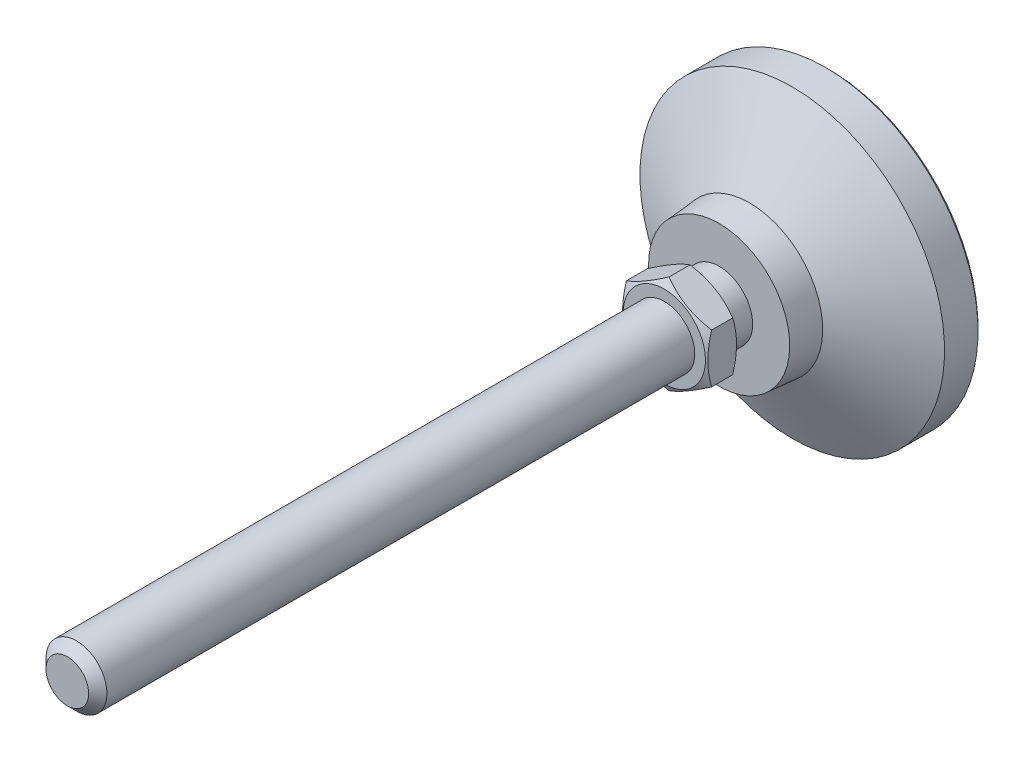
ISO-10303-21;
HEADER;
FILE_DESCRIPTION(('STEP AP214'),'2;1');
FILE_NAME('part.step','',(''),(''),'','','');
FILE_SCHEMA(('AUTOMOTIVE_DESIGN { 1 0 10303 214 1 1 1 1 }'));
ENDSEC;
DATA;
#1=APPLICATION_CONTEXT('core data for automotive mechanical design processes');
#2=APPLICATION_PROTOCOL_DEFINITION('international standard','automotive_design',2000,#1);
#3=PRODUCT_CONTEXT('',#1,'mechanical');
#4=PRODUCT('Part','Part','',(#3));
#5=PRODUCT_RELATED_PRODUCT_CATEGORY('part','',(#4));
#6=PRODUCT_DEFINITION_FORMATION('','',#4);
#7=PRODUCT_DEFINITION_CONTEXT('part definition',#1,'design');
#8=PRODUCT_DEFINITION('design','',#6,#7);
#9=PRODUCT_DEFINITION_SHAPE('','',#8);
#10=(LENGTH_UNIT() NAMED_UNIT(*) SI_UNIT(.MILLI.,.METRE.));
#11=(NAMED_UNIT(*) PLANE_ANGLE_UNIT() SI_UNIT($,.RADIAN.));
#12=(NAMED_UNIT(*) SI_UNIT($,.STERADIAN.) SOLID_ANGLE_UNIT());
#13=UNCERTAINTY_MEASURE_WITH_UNIT(LENGTH_MEASURE(1.E-05),#10,'distance_accuracy_value','');
#14=(GEOMETRIC_REPRESENTATION_CONTEXT(3) GLOBAL_UNCERTAINTY_ASSIGNED_CONTEXT((#13)) GLOBAL_UNIT_ASSIGNED_CONTEXT((#10,
#11,#12)) REPRESENTATION_CONTEXT('',''));
#15=CARTESIAN_POINT('',(0.,0.,0.));
#16=DIRECTION('',(0.,0.,1.));
#17=DIRECTION('',(1.,0.,0.));
#18=AXIS2_PLACEMENT_3D('',#15,#16,#17);
#19=CARTESIAN_POINT('',(0.,0.,-1.));
#20=DIRECTION('',(0.,0.,-1.));
#21=DIRECTION('',(0.,1.,0.));
#22=AXIS2_PLACEMENT_3D('',#19,#20,#21);
#23=CYLINDRICAL_SURFACE('',#22,5.50000000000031);
#24=CARTESIAN_POINT('',(0.,0.,22.));
#25=DIRECTION('',(0.,0.,-1.));
#26=DIRECTION('',(0.,1.,0.));
#27=AXIS2_PLACEMENT_3D('',#24,#25,#26);
#28=CIRCLE('',#27,5.50000000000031);
#29=CARTESIAN_POINT('',(0.,5.50000000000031,22.));
#30=VERTEX_POINT('',#29);
#31=EDGE_CURVE('E100',#30,#30,#28,.T.);
#32=ORIENTED_EDGE('',*,*,#31,.T.);
#33=EDGE_LOOP('',(#32));
#34=FACE_BOUND('',#33,.T.);
#35=CARTESIAN_POINT('',(0.,0.,18.));
#36=DIRECTION('',(0.,0.,-1.));
#37=DIRECTION('',(0.,1.,0.));
#38=AXIS2_PLACEMENT_3D('',#35,#36,#37);
#39=CIRCLE('',#38,5.50000000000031);
#40=CARTESIAN_POINT('',(0.,5.50000000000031,18.));
#41=VERTEX_POINT('',#40);
#42=EDGE_CURVE('E93',#41,#41,#39,.T.);
#43=ORIENTED_EDGE('',*,*,#42,.F.);
#44=EDGE_LOOP('',(#43));
#45=FACE_BOUND('',#44,.T.);
#46=ADVANCED_FACE('F14',(#34,#45),#23,.T.);
#47=CARTESIAN_POINT('',(-5.50000000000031,0.,22.));
#48=DIRECTION('',(0.,0.,1.));
#49=DIRECTION('',(0.,-1.,0.));
#50=AXIS2_PLACEMENT_3D('',#47,#48,#49);
#51=PLANE('',#50);
#52=CARTESIAN_POINT('',(0.,0.,22.));
#53=DIRECTION('',(0.,0.,1.));
#54=DIRECTION('',(0.,-1.,0.));
#55=AXIS2_PLACEMENT_3D('',#52,#53,#54);
#56=CIRCLE('',#55,6.75);
#57=CARTESIAN_POINT('',(0.,-6.75,22.));
#58=VERTEX_POINT('',#57);
#59=EDGE_CURVE('E280',#58,#58,#56,.T.);
#60=ORIENTED_EDGE('',*,*,#59,.F.);
#61=EDGE_LOOP('',(#60));
#62=FACE_BOUND('',#61,.T.);
#63=ORIENTED_EDGE('',*,*,#31,.F.);
#64=EDGE_LOOP('',(#63));
#65=FACE_BOUND('',#64,.T.);
#66=ADVANCED_FACE('F141',(#62,#65),#51,.F.);
#67=CARTESIAN_POINT('',(0.,5.50000000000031,18.));
#68=DIRECTION('',(0.,0.,-1.));
#69=DIRECTION('',(0.,1.,0.));
#70=AXIS2_PLACEMENT_3D('',#67,#68,#69);
#71=PLANE('',#70);
#72=ORIENTED_EDGE('',*,*,#42,.T.);
#73=EDGE_LOOP('',(#72));
#74=FACE_BOUND('',#73,.T.);
#75=CARTESIAN_POINT('',(0.,0.,18.));
#76=DIRECTION('',(0.,0.,-1.));
#77=DIRECTION('',(0.,1.,0.));
#78=AXIS2_PLACEMENT_3D('',#75,#76,#77);
#79=CIRCLE('',#78,11.5833333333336);
#80=CARTESIAN_POINT('',(0.,11.5833333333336,18.));
#81=VERTEX_POINT('',#80);
#82=EDGE_CURVE('E88',#81,#81,#79,.T.);
#83=ORIENTED_EDGE('',*,*,#82,.F.);
#84=EDGE_LOOP('',(#83));
#85=FACE_BOUND('',#84,.T.);
#86=ADVANCED_FACE('F147',(#74,#85),#71,.F.);
#87=CARTESIAN_POINT('',(0.,0.,0.));
#88=DIRECTION('',(0.,0.,1.));
#89=DIRECTION('',(0.,-1.,0.));
#90=AXIS2_PLACEMENT_3D('',#87,#88,#89);
#91=PLANE('',#90);
#92=CARTESIAN_POINT('',(0.,0.,0.));
#93=DIRECTION('',(0.,0.,1.));
#94=DIRECTION('',(0.,-1.,0.));
#95=AXIS2_PLACEMENT_3D('',#92,#93,#94);
#96=CIRCLE('',#95,24.5);
#97=CARTESIAN_POINT('',(0.,-24.5,0.));
#98=VERTEX_POINT('',#97);
#99=EDGE_CURVE('E28',#98,#98,#96,.F.);
#100=ORIENTED_EDGE('',*,*,#99,.T.);
#101=EDGE_LOOP('',(#100));
#102=FACE_BOUND('',#101,.T.);
#103=ADVANCED_FACE('F114',(#102),#91,.F.);
#104=CARTESIAN_POINT('',(0.,0.,-1.));
#105=DIRECTION('',(0.,0.,-1.));
#106=DIRECTION('',(0.,1.,0.));
#107=AXIS2_PLACEMENT_3D('',#104,#105,#106);
#108=CYLINDRICAL_SURFACE('',#107,25.);
#109=CARTESIAN_POINT('',(0.,0.,0.5));
#110=DIRECTION('',(0.,0.,1.));
#111=DIRECTION('',(0.,-1.,0.));
#112=AXIS2_PLACEMENT_3D('',#109,#110,#111);
#113=CIRCLE('',#112,25.);
#114=CARTESIAN_POINT('',(0.,-25.,0.5));
#115=VERTEX_POINT('',#114);
#116=EDGE_CURVE('E108',#115,#115,#113,.T.);
#117=ORIENTED_EDGE('',*,*,#116,.T.);
#118=EDGE_LOOP('',(#117));
#119=FACE_BOUND('',#118,.T.);
#120=CARTESIAN_POINT('',(0.,0.,6.));
#121=DIRECTION('',(0.,0.,-1.));
#122=DIRECTION('',(0.,1.,0.));
#123=AXIS2_PLACEMENT_3D('',#120,#121,#122);
#124=CIRCLE('',#123,25.);
#125=CARTESIAN_POINT('',(0.,25.,6.));
#126=VERTEX_POINT('',#125);
#127=EDGE_CURVE('E106',#126,#126,#124,.T.);
#128=ORIENTED_EDGE('',*,*,#127,.T.);
#129=EDGE_LOOP('',(#128));
#130=FACE_BOUND('',#129,.T.);
#131=ADVANCED_FACE('F121',(#119,#130),#108,.T.);
#132=CARTESIAN_POINT('',(0.,0.,13.));
#133=DIRECTION('',(0.,0.,-1.));
#134=DIRECTION('',(0.,1.,0.));
#135=AXIS2_PLACEMENT_3D('',#132,#133,#134);
#136=CONICAL_SURFACE('',#135,12.0000000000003,1.07685495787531);
#137=ORIENTED_EDGE('',*,*,#127,.F.);
#138=EDGE_LOOP('',(#137));
#139=FACE_BOUND('',#138,.T.);
#140=CARTESIAN_POINT('',(0.,0.,13.));
#141=DIRECTION('',(0.,0.,-1.));
#142=DIRECTION('',(0.,1.,0.));
#143=AXIS2_PLACEMENT_3D('',#140,#141,#142);
#144=CIRCLE('',#143,12.0000000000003);
#145=CARTESIAN_POINT('',(0.,12.0000000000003,13.));
#146=VERTEX_POINT('',#145);
#147=EDGE_CURVE('E103',#146,#146,#144,.T.);
#148=ORIENTED_EDGE('',*,*,#147,.T.);
#149=EDGE_LOOP('',(#148));
#150=FACE_BOUND('',#149,.T.);
#151=ADVANCED_FACE('F124',(#139,#150),#136,.T.);
#152=CARTESIAN_POINT('',(0.,0.,19.));
#153=DIRECTION('',(0.,0.,-1.));
#154=DIRECTION('',(0.,1.,0.));
#155=AXIS2_PLACEMENT_3D('',#152,#153,#154);
#156=CONICAL_SURFACE('',#155,11.5000000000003,0.0831412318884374);
#157=ORIENTED_EDGE('',*,*,#82,.T.);
#158=EDGE_LOOP('',(#157));
#159=FACE_BOUND('',#158,.T.);
#160=ORIENTED_EDGE('',*,*,#147,.F.);
#161=EDGE_LOOP('',(#160));
#162=FACE_BOUND('',#161,.T.);
#163=ADVANCED_FACE('F118',(#159,#162),#156,.T.);
#164=CARTESIAN_POINT('',(0.,0.,0.5));
#165=DIRECTION('',(0.,0.,1.));
#166=DIRECTION('',(0.,-1.,0.));
#167=AXIS2_PLACEMENT_3D('',#164,#165,#166);
#168=CONICAL_SURFACE('',#167,25.,0.785398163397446);
#169=ORIENTED_EDGE('',*,*,#99,.F.);
#170=EDGE_LOOP('',(#169));
#171=FACE_BOUND('',#170,.T.);
#172=ORIENTED_EDGE('',*,*,#116,.F.);
#173=EDGE_LOOP('',(#172));
#174=FACE_BOUND('',#173,.T.);
#175=ADVANCED_FACE('F16',(#171,#174),#168,.T.);
#176=CARTESIAN_POINT('',(0.,0.,22.));
#177=DIRECTION('',(0.,0.,1.));
#178=DIRECTION('',(0.,-1.,0.));
#179=AXIS2_PLACEMENT_3D('',#176,#177,#178);
#180=CONICAL_SURFACE('',#179,6.75,1.0471975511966);
#181=CARTESIAN_POINT('',(0.000200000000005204,-8.08301923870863,22.7696190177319));
#182=CARTESIAN_POINT('',(-0.15366790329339,-7.99418356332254,22.7183374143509));
#183=CARTESIAN_POINT('',(-0.30810950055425,-7.90501666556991,22.669383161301));
#184=CARTESIAN_POINT('',(-0.618246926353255,-7.72595873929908,22.5767703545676));
#185=CARTESIAN_POINT('',(-0.773943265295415,-7.63606741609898,22.5331140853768));
#186=CARTESIAN_POINT('',(-1.24352516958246,-7.36495417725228,22.4109491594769));
#187=CARTESIAN_POINT('',(-1.5592643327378,-7.18266208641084,22.3414631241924));
#188=CARTESIAN_POINT('',(-2.03176224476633,-6.90986528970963,22.2599825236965));
#189=CARTESIAN_POINT('',(-2.18710922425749,-6.82017566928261,22.2367710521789));
#190=CARTESIAN_POINT('',(-2.49850511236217,-6.64039116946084,22.1978487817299));
#191=CARTESIAN_POINT('',(-2.65455395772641,-6.55029632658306,22.1821373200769));
#192=CARTESIAN_POINT('',(-2.96692267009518,-6.36995016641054,22.1586154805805));
#193=CARTESIAN_POINT('',(-3.12324202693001,-6.27969914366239,22.1507961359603));
#194=CARTESIAN_POINT('',(-3.43601650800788,-6.09911871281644,22.1432178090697));
#195=CARTESIAN_POINT('',(-3.59247162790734,-6.00878930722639,22.1434585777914));
#196=CARTESIAN_POINT('',(-4.02110687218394,-5.76131663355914,22.155197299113));
#197=CARTESIAN_POINT('',(-4.2931466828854,-5.60425437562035,22.1749033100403));
#198=CARTESIAN_POINT('',(-4.8354194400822,-5.29117305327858,22.2373910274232));
#199=CARTESIAN_POINT('',(-5.10565047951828,-5.13515508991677,22.2801940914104));
#200=CARTESIAN_POINT('',(-5.64901454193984,-4.82144370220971,22.3871892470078));
#201=CARTESIAN_POINT('',(-5.92207900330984,-4.66378986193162,22.4518346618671));
#202=CARTESIAN_POINT('',(-6.46413578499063,-4.35083323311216,22.5985536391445));
#203=CARTESIAN_POINT('',(-6.73313504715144,-4.1955264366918,22.680592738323));
#204=CARTESIAN_POINT('',(-7.0002,-4.04133641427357,22.7696190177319));
#205=B_SPLINE_CURVE_WITH_KNOTS('',3,(#181,#182,#183,#184,#185,#186,#187,#188,#189,#190,#191,
#192,#193,#194,#195,#196,#197,#198,#199,#200,#201,#202,#203,#204),.UNSPECIFIED.,.F.,.F.,(4,2,2,
2,2,2,2,2,2,2,2,4),(0.,0.554727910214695,1.10969417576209,2.2219327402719,2.76443041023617,
3.30688013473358,3.8487128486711,4.39052882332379,5.33376515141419,6.27787517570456,
7.2429241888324,8.20607866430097),.UNSPECIFIED.);
#206=CARTESIAN_POINT('',(0.,-8.08290376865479,22.7695523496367));
#207=VERTEX_POINT('',#206);
#208=CARTESIAN_POINT('',(-7.,-4.04145188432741,22.7695523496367));
#209=VERTEX_POINT('',#208);
#210=EDGE_CURVE('E73',#207,#209,#205,.T.);
#211=ORIENTED_EDGE('',*,*,#210,.T.);
#212=CARTESIAN_POINT('',(-7.,10.8803490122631,25.5724237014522));
#213=CARTESIAN_POINT('',(-7.,10.5744058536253,25.423915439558));
#214=CARTESIAN_POINT('',(-7.,10.2677630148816,25.2768240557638));
#215=CARTESIAN_POINT('',(-7.,9.65270597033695,24.9862714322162));
#216=CARTESIAN_POINT('',(-7.,9.34429149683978,24.8428107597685));
#217=CARTESIAN_POINT('',(-7.,8.72374189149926,24.5595994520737));
#218=CARTESIAN_POINT('',(-7.,8.41159566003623,24.4198730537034));
#219=CARTESIAN_POINT('',(-7.,7.78482911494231,24.1461056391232));
#220=CARTESIAN_POINT('',(-7.,7.47020891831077,24.0120643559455));
#221=CARTESIAN_POINT('',(-7.,6.82774549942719,23.7469381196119));
#222=CARTESIAN_POINT('',(-7.,6.49980413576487,23.6160896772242));
#223=CARTESIAN_POINT('',(-7.,5.84009458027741,23.3642365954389));
#224=CARTESIAN_POINT('',(-7.,5.5083259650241,23.2432330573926));
#225=CARTESIAN_POINT('',(-7.,4.84104313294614,23.0142287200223));
#226=CARTESIAN_POINT('',(-7.,4.50553797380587,22.9062018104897));
#227=CARTESIAN_POINT('',(-7.,3.82972694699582,22.7065995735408));
#228=CARTESIAN_POINT('',(-7.,3.48942262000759,22.6150190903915));
#229=CARTESIAN_POINT('',(-7.,2.80565693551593,22.4531827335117));
#230=CARTESIAN_POINT('',(-7.,2.46222391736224,22.3828103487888));
#231=CARTESIAN_POINT('',(-7.,1.94392701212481,22.2961919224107));
#232=CARTESIAN_POINT('',(-7.,1.77062408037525,22.2704746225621));
#233=CARTESIAN_POINT('',(-7.,1.42314928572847,22.2258574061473));
#234=CARTESIAN_POINT('',(-7.,1.24897751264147,22.2069567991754));
#235=CARTESIAN_POINT('',(-7.,0.902283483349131,22.1765876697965));
#236=CARTESIAN_POINT('',(-7.,0.729769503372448,22.1650250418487));
#237=CARTESIAN_POINT('',(-7.,0.384407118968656,22.149206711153));
#238=CARTESIAN_POINT('',(-7.,0.21155872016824,22.1449508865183));
#239=CARTESIAN_POINT('',(-7.,-0.134163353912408,22.1438477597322));
#240=CARTESIAN_POINT('',(-7.,-0.307037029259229,22.1470004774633));
#241=CARTESIAN_POINT('',(-7.,-0.652497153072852,22.1606370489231));
#242=CARTESIAN_POINT('',(-7.,-0.825083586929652,22.1711212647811));
#243=CARTESIAN_POINT('',(-7.,-1.23911459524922,22.2048444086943));
#244=CARTESIAN_POINT('',(-7.,-1.48028519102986,22.231520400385));
#245=CARTESIAN_POINT('',(-7.,-1.96084120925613,22.2977388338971));
#246=CARTESIAN_POINT('',(-7.,-2.20022638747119,22.3372830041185));
#247=CARTESIAN_POINT('',(-7.,-2.91542720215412,22.4731213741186));
#248=CARTESIAN_POINT('',(-7.,-3.3880230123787,22.5865969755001));
#249=CARTESIAN_POINT('',(-7.,-4.09471812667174,22.7834421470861));
#250=CARTESIAN_POINT('',(-7.,-4.33248106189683,22.8544159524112));
#251=CARTESIAN_POINT('',(-7.,-4.80569777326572,23.003752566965));
#252=CARTESIAN_POINT('',(-7.,-5.0411515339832,23.0821154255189));
#253=CARTESIAN_POINT('',(-7.,-5.50982367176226,23.2449713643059));
#254=CARTESIAN_POINT('',(-7.,-5.74304275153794,23.3294624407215));
#255=CARTESIAN_POINT('',(-7.,-6.20754735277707,23.5035789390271));
#256=CARTESIAN_POINT('',(-7.,-6.43883289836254,23.5932042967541));
#257=CARTESIAN_POINT('',(-7.,-6.99048769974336,23.8128986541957));
#258=CARTESIAN_POINT('',(-7.,-7.31005058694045,23.9449888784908));
#259=CARTESIAN_POINT('',(-7.,-7.94641009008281,24.2156921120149));
#260=CARTESIAN_POINT('',(-7.,-8.26320652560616,24.3543055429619));
#261=CARTESIAN_POINT('',(-7.,-8.89455089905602,24.636726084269));
#262=CARTESIAN_POINT('',(-7.,-9.20909834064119,24.7805343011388));
#263=CARTESIAN_POINT('',(-7.,-9.83627149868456,25.072289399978));
#264=CARTESIAN_POINT('',(-7.,-10.1488971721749,25.2202363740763));
#265=CARTESIAN_POINT('',(-7.,-10.7728867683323,25.5196447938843));
#266=CARTESIAN_POINT('',(-7.,-11.0842488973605,25.6711099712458));
#267=CARTESIAN_POINT('',(-7.,-11.7056209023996,25.9767917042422));
#268=CARTESIAN_POINT('',(-7.,-12.0156307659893,26.1310082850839));
#269=CARTESIAN_POINT('',(-7.,-12.9438724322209,26.5970005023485));
#270=CARTESIAN_POINT('',(-7.,-13.5604045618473,26.9121613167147));
#271=CARTESIAN_POINT('',(-7.,-14.7374991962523,27.5215257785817));
#272=CARTESIAN_POINT('',(-7.,-15.2983311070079,27.8152113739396));
#273=CARTESIAN_POINT('',(-7.,-16.4179201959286,28.4065585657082));
#274=CARTESIAN_POINT('',(-7.,-16.9766772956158,28.7042203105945));
#275=CARTESIAN_POINT('',(-7.,-18.0911368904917,29.3017925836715));
#276=CARTESIAN_POINT('',(-7.,-18.6468435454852,29.6016953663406));
#277=CARTESIAN_POINT('',(-7.,-19.7569339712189,30.2038650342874));
#278=CARTESIAN_POINT('',(-7.,-20.3113178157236,30.5061317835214));
#279=CARTESIAN_POINT('',(-7.,-20.8652167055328,30.8092786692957));
#280=B_SPLINE_CURVE_WITH_KNOTS('',3,(#212,#213,#214,#215,#216,#217,#218,#219,#220,#221,#222,
#223,#224,#225,#226,#227,#228,#229,#230,#231,#232,#233,#234,#235,#236,#237,#238,#239,#240,#241,
#242,#243,#244,#245,#246,#247,#248,#249,#250,#251,#252,#253,#254,#255,#256,#257,#258,#259,#260,
#261,#262,#263,#264,#265,#266,#267,#268,#269,#270,#271,#272,#273,#274,#275,#276,#277,#278,#279),
.UNSPECIFIED.,.F.,.F.,(4,2,2,2,2,2,2,2,2,2,2,2,2,2,2,2,2,2,2,2,2,2,2,2,2,2,2,2,2,2,2,2,2,4),(0.,
1.02025901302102,2.04067647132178,3.06660794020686,4.0924911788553,5.15161431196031,
6.21085576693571,7.26792890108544,8.32467007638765,9.37549531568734,9.90098446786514,
10.4264203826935,10.9449739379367,11.4635188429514,11.9820651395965,12.5006370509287,
13.2281507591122,13.9557622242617,15.4117802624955,16.1561077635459,16.9004402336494,
17.6445304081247,18.3886112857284,19.4258720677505,20.4631999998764,21.5007502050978,
22.5383235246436,23.5770527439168,24.6157914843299,26.6929748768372,28.5921822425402,
30.4914607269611,32.3858580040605,34.2801470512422),.UNSPECIFIED.);
#281=CARTESIAN_POINT('',(-7.,4.04145188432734,22.7695523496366));
#282=VERTEX_POINT('',#281);
#283=EDGE_CURVE('E81',#209,#282,#280,.F.);
#284=ORIENTED_EDGE('',*,*,#283,.T.);
#285=CARTESIAN_POINT('',(-7.0002,4.0413364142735,22.7696190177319));
#286=CARTESIAN_POINT('',(-6.84633209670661,4.13017208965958,22.7183374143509));
#287=CARTESIAN_POINT('',(-6.69189049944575,4.21933898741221,22.669383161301));
#288=CARTESIAN_POINT('',(-6.38175307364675,4.39839691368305,22.5767703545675));
#289=CARTESIAN_POINT('',(-6.22605673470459,4.48828823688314,22.5331140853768));
#290=CARTESIAN_POINT('',(-5.75647483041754,4.75940147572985,22.4109491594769));
#291=CARTESIAN_POINT('',(-5.4407356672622,4.94169356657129,22.3414631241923));
#292=CARTESIAN_POINT('',(-4.96823775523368,5.21449036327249,22.2599825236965));
#293=CARTESIAN_POINT('',(-4.81289077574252,5.30417998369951,22.2367710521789));
#294=CARTESIAN_POINT('',(-4.50149488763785,5.48396448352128,22.1978487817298));
#295=CARTESIAN_POINT('',(-4.3454460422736,5.57405932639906,22.1821373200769));
#296=CARTESIAN_POINT('',(-4.03307732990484,5.75440548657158,22.1586154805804));
#297=CARTESIAN_POINT('',(-3.87675797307,5.84465650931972,22.1507961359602));
#298=CARTESIAN_POINT('',(-3.56398349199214,6.02523694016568,22.1432178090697));
#299=CARTESIAN_POINT('',(-3.40752837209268,6.11556634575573,22.1434585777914));
#300=CARTESIAN_POINT('',(-2.97889312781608,6.36303901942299,22.155197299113));
#301=CARTESIAN_POINT('',(-2.70685331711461,6.52010127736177,22.1749033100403));
#302=CARTESIAN_POINT('',(-2.1645805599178,6.83318259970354,22.2373910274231));
#303=CARTESIAN_POINT('',(-1.89434952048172,6.98920056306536,22.2801940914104));
#304=CARTESIAN_POINT('',(-1.35098545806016,7.30291195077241,22.3871892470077));
#305=CARTESIAN_POINT('',(-1.07792099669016,7.46056579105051,22.451834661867));
#306=CARTESIAN_POINT('',(-0.535864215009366,7.77352241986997,22.5985536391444));
#307=CARTESIAN_POINT('',(-0.266864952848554,7.92882921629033,22.6805927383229));
#308=CARTESIAN_POINT('',(0.000200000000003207,8.08301923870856,22.7696190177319));
#309=B_SPLINE_CURVE_WITH_KNOTS('',3,(#285,#286,#287,#288,#289,#290,#291,#292,#293,#294,#295,
#296,#297,#298,#299,#300,#301,#302,#303,#304,#305,#306,#307,#308),.UNSPECIFIED.,.F.,.F.,(4,2,2,
2,2,2,2,2,2,2,2,4),(0.,0.554727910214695,1.10969417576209,2.22193274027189,2.76443041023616,
3.30688013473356,3.84871284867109,4.39052882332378,5.33376515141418,6.27787517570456,
7.24292418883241,8.20607866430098),.UNSPECIFIED.);
#310=CARTESIAN_POINT('',(0.,8.08290376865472,22.7695523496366));
#311=VERTEX_POINT('',#310);
#312=EDGE_CURVE('E213',#282,#311,#309,.T.);
#313=ORIENTED_EDGE('',*,*,#312,.T.);
#314=CARTESIAN_POINT('',(-0.000199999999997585,8.08301923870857,22.7696190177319));
#315=CARTESIAN_POINT('',(0.153667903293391,7.99418356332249,22.7183374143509));
#316=CARTESIAN_POINT('',(0.308109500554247,7.90501666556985,22.669383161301));
#317=CARTESIAN_POINT('',(0.61824692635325,7.72595873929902,22.5767703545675));
#318=CARTESIAN_POINT('',(0.773943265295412,7.63606741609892,22.5331140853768));
#319=CARTESIAN_POINT('',(1.24352516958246,7.36495417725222,22.4109491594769));
#320=CARTESIAN_POINT('',(1.5592643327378,7.18266208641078,22.3414631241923));
#321=CARTESIAN_POINT('',(2.03176224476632,6.90986528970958,22.2599825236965));
#322=CARTESIAN_POINT('',(2.18710922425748,6.82017566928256,22.2367710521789));
#323=CARTESIAN_POINT('',(2.49850511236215,6.64039116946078,22.1978487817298));
#324=CARTESIAN_POINT('',(2.6545539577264,6.55029632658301,22.1821373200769));
#325=CARTESIAN_POINT('',(2.96692267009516,6.36995016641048,22.1586154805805));
#326=CARTESIAN_POINT('',(3.12324202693,6.27969914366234,22.1507961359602));
#327=CARTESIAN_POINT('',(3.43601650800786,6.09911871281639,22.1432178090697));
#328=CARTESIAN_POINT('',(3.59247162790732,6.00878930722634,22.1434585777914));
#329=CARTESIAN_POINT('',(4.02110687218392,5.76131663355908,22.155197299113));
#330=CARTESIAN_POINT('',(4.29314668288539,5.6042543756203,22.1749033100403));
#331=CARTESIAN_POINT('',(4.83541944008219,5.29117305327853,22.2373910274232));
#332=CARTESIAN_POINT('',(5.10565047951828,5.13515508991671,22.2801940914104));
#333=CARTESIAN_POINT('',(5.64901454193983,4.82144370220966,22.3871892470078));
#334=CARTESIAN_POINT('',(5.92207900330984,4.66378986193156,22.4518346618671));
#335=CARTESIAN_POINT('',(6.46413578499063,4.3508332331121,22.5985536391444));
#336=CARTESIAN_POINT('',(6.73313504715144,4.19552643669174,22.680592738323));
#337=CARTESIAN_POINT('',(7.0002,4.04133641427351,22.7696190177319));
#338=B_SPLINE_CURVE_WITH_KNOTS('',3,(#314,#315,#316,#317,#318,#319,#320,#321,#322,#323,#324,
#325,#326,#327,#328,#329,#330,#331,#332,#333,#334,#335,#336,#337),.UNSPECIFIED.,.F.,.F.,(4,2,2,
2,2,2,2,2,2,2,2,4),(0.,0.554727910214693,1.10969417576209,2.22193274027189,2.76443041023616,
3.30688013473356,3.84871284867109,4.39052882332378,5.33376515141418,6.27787517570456,
7.2429241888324,8.20607866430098),.UNSPECIFIED.);
#339=CARTESIAN_POINT('',(7.,4.04145188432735,22.7695523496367));
#340=VERTEX_POINT('',#339);
#341=EDGE_CURVE('E207',#311,#340,#338,.T.);
#342=ORIENTED_EDGE('',*,*,#341,.T.);
#343=CARTESIAN_POINT('',(7.,10.8803490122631,25.5724237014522));
#344=CARTESIAN_POINT('',(7.,10.5744058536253,25.423915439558));
#345=CARTESIAN_POINT('',(7.,10.2677630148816,25.2768240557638));
#346=CARTESIAN_POINT('',(7.,9.65270597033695,24.9862714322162));
#347=CARTESIAN_POINT('',(7.,9.34429149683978,24.8428107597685));
#348=CARTESIAN_POINT('',(7.,8.72374189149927,24.5595994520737));
#349=CARTESIAN_POINT('',(7.,8.41159566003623,24.4198730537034));
#350=CARTESIAN_POINT('',(7.,7.78482911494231,24.1461056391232));
#351=CARTESIAN_POINT('',(7.,7.47020891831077,24.0120643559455));
#352=CARTESIAN_POINT('',(7.,6.82774549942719,23.7469381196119));
#353=CARTESIAN_POINT('',(7.,6.49980413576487,23.6160896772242));
#354=CARTESIAN_POINT('',(7.,5.84009458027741,23.3642365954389));
#355=CARTESIAN_POINT('',(7.,5.5083259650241,23.2432330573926));
#356=CARTESIAN_POINT('',(7.,4.84104313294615,23.0142287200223));
#357=CARTESIAN_POINT('',(7.,4.50553797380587,22.9062018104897));
#358=CARTESIAN_POINT('',(7.,3.82972694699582,22.7065995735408));
#359=CARTESIAN_POINT('',(7.,3.4894226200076,22.6150190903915));
#360=CARTESIAN_POINT('',(7.,2.80565693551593,22.4531827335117));
#361=CARTESIAN_POINT('',(7.,2.46222391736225,22.3828103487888));
#362=CARTESIAN_POINT('',(7.,1.94392701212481,22.2961919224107));
#363=CARTESIAN_POINT('',(7.,1.77062408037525,22.2704746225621));
#364=CARTESIAN_POINT('',(7.,1.42314928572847,22.2258574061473));
#365=CARTESIAN_POINT('',(7.,1.24897751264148,22.2069567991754));
#366=CARTESIAN_POINT('',(7.,0.902283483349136,22.1765876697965));
#367=CARTESIAN_POINT('',(7.,0.729769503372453,22.1650250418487));
#368=CARTESIAN_POINT('',(7.,0.384407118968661,22.149206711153));
#369=CARTESIAN_POINT('',(7.,0.211558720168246,22.1449508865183));
#370=CARTESIAN_POINT('',(7.,-0.134163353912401,22.1438477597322));
#371=CARTESIAN_POINT('',(7.,-0.307037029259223,22.1470004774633));
#372=CARTESIAN_POINT('',(7.,-0.652497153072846,22.1606370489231));
#373=CARTESIAN_POINT('',(7.,-0.825083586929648,22.1711212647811));
#374=CARTESIAN_POINT('',(7.,-1.23911459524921,22.2048444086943));
#375=CARTESIAN_POINT('',(7.,-1.48028519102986,22.231520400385));
#376=CARTESIAN_POINT('',(7.,-1.96084120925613,22.2977388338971));
#377=CARTESIAN_POINT('',(7.,-2.20022638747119,22.3372830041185));
#378=CARTESIAN_POINT('',(7.,-2.91542720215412,22.4731213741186));
#379=CARTESIAN_POINT('',(7.,-3.38802301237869,22.5865969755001));
#380=CARTESIAN_POINT('',(7.,-4.09471812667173,22.7834421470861));
#381=CARTESIAN_POINT('',(7.,-4.33248106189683,22.8544159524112));
#382=CARTESIAN_POINT('',(7.,-4.80569777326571,23.003752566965));
#383=CARTESIAN_POINT('',(7.,-5.0411515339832,23.0821154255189));
#384=CARTESIAN_POINT('',(7.,-5.50982367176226,23.2449713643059));
#385=CARTESIAN_POINT('',(7.,-5.74304275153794,23.3294624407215));
#386=CARTESIAN_POINT('',(7.,-6.20754735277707,23.5035789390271));
#387=CARTESIAN_POINT('',(7.,-6.43883289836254,23.5932042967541));
#388=CARTESIAN_POINT('',(7.,-6.99048769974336,23.8128986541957));
#389=CARTESIAN_POINT('',(7.,-7.31005058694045,23.9449888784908));
#390=CARTESIAN_POINT('',(7.,-7.94641009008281,24.2156921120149));
#391=CARTESIAN_POINT('',(7.,-8.26320652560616,24.3543055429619));
#392=CARTESIAN_POINT('',(7.,-8.89455089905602,24.636726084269));
#393=CARTESIAN_POINT('',(7.,-9.20909834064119,24.7805343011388));
#394=CARTESIAN_POINT('',(7.,-9.83627149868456,25.072289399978));
#395=CARTESIAN_POINT('',(7.,-10.1488971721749,25.2202363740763));
#396=CARTESIAN_POINT('',(7.,-10.7728867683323,25.5196447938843));
#397=CARTESIAN_POINT('',(7.,-11.0842488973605,25.6711099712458));
#398=CARTESIAN_POINT('',(7.,-11.7056209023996,25.9767917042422));
#399=CARTESIAN_POINT('',(7.,-12.0156307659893,26.1310082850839));
#400=CARTESIAN_POINT('',(7.,-12.9438724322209,26.5970005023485));
#401=CARTESIAN_POINT('',(7.,-13.5604045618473,26.9121613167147));
#402=CARTESIAN_POINT('',(7.,-14.7374991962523,27.5215257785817));
#403=CARTESIAN_POINT('',(7.,-15.2983311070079,27.8152113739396));
#404=CARTESIAN_POINT('',(7.,-16.4179201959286,28.4065585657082));
#405=CARTESIAN_POINT('',(7.,-16.9766772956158,28.7042203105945));
#406=CARTESIAN_POINT('',(7.,-18.0911368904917,29.3017925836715));
#407=CARTESIAN_POINT('',(7.,-18.6468435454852,29.6016953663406));
#408=CARTESIAN_POINT('',(7.,-19.7569339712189,30.2038650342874));
#409=CARTESIAN_POINT('',(7.,-20.3113178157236,30.5061317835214));
#410=CARTESIAN_POINT('',(7.,-20.8652167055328,30.8092786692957));
#411=B_SPLINE_CURVE_WITH_KNOTS('',3,(#343,#344,#345,#346,#347,#348,#349,#350,#351,#352,#353,
#354,#355,#356,#357,#358,#359,#360,#361,#362,#363,#364,#365,#366,#367,#368,#369,#370,#371,#372,
#373,#374,#375,#376,#377,#378,#379,#380,#381,#382,#383,#384,#385,#386,#387,#388,#389,#390,#391,
#392,#393,#394,#395,#396,#397,#398,#399,#400,#401,#402,#403,#404,#405,#406,#407,#408,#409,#410),
.UNSPECIFIED.,.F.,.F.,(4,2,2,2,2,2,2,2,2,2,2,2,2,2,2,2,2,2,2,2,2,2,2,2,2,2,2,2,2,2,2,2,2,4),(0.,
1.02025901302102,2.04067647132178,3.06660794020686,4.0924911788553,5.15161431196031,
6.21085576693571,7.26792890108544,8.32467007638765,9.37549531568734,9.90098446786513,
10.4264203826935,10.9449739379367,11.4635188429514,11.9820651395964,12.5006370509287,
13.2281507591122,13.9557622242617,15.4117802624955,16.1561077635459,16.9004402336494,
17.6445304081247,18.3886112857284,19.4258720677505,20.4631999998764,21.5007502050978,
22.5383235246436,23.5770527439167,24.6157914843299,26.6929748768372,28.5921822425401,
30.4914607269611,32.3858580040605,34.2801470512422),.UNSPECIFIED.);
#412=CARTESIAN_POINT('',(7.,-4.04145188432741,22.7695523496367));
#413=VERTEX_POINT('',#412);
#414=EDGE_CURVE('E34',#340,#413,#411,.T.);
#415=ORIENTED_EDGE('',*,*,#414,.T.);
#416=CARTESIAN_POINT('',(7.0002,-4.04133641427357,22.7696190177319));
#417=CARTESIAN_POINT('',(6.84633209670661,-4.13017208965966,22.7183374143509));
#418=CARTESIAN_POINT('',(6.69189049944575,-4.21933898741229,22.669383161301));
#419=CARTESIAN_POINT('',(6.38175307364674,-4.39839691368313,22.5767703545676));
#420=CARTESIAN_POINT('',(6.22605673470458,-4.48828823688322,22.5331140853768));
#421=CARTESIAN_POINT('',(5.75647483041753,-4.75940147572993,22.4109491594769));
#422=CARTESIAN_POINT('',(5.44073566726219,-4.94169356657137,22.3414631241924));
#423=CARTESIAN_POINT('',(4.96823775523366,-5.21449036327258,22.2599825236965));
#424=CARTESIAN_POINT('',(4.81289077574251,-5.30417998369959,22.2367710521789));
#425=CARTESIAN_POINT('',(4.50149488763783,-5.48396448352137,22.1978487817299));
#426=CARTESIAN_POINT('',(4.34544604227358,-5.57405932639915,22.1821373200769));
#427=CARTESIAN_POINT('',(4.03307732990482,-5.75440548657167,22.1586154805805));
#428=CARTESIAN_POINT('',(3.87675797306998,-5.84465650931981,22.1507961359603));
#429=CARTESIAN_POINT('',(3.56398349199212,-6.02523694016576,22.1432178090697));
#430=CARTESIAN_POINT('',(3.40752837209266,-6.11556634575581,22.1434585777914));
#431=CARTESIAN_POINT('',(2.97889312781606,-6.36303901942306,22.155197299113));
#432=CARTESIAN_POINT('',(2.7068533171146,-6.52010127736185,22.1749033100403));
#433=CARTESIAN_POINT('',(2.1645805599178,-6.83318259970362,22.2373910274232));
#434=CARTESIAN_POINT('',(1.89434952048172,-6.98920056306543,22.2801940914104));
#435=CARTESIAN_POINT('',(1.35098545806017,-7.30291195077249,22.3871892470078));
#436=CARTESIAN_POINT('',(1.07792099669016,-7.46056579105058,22.4518346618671));
#437=CARTESIAN_POINT('',(0.535864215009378,-7.77352241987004,22.5985536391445));
#438=CARTESIAN_POINT('',(0.266864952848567,-7.9288292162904,22.680592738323));
#439=CARTESIAN_POINT('',(-0.000199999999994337,-8.08301923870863,22.7696190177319));
#440=B_SPLINE_CURVE_WITH_KNOTS('',3,(#416,#417,#418,#419,#420,#421,#422,#423,#424,#425,#426,
#427,#428,#429,#430,#431,#432,#433,#434,#435,#436,#437,#438,#439),.UNSPECIFIED.,.F.,.F.,(4,2,2,
2,2,2,2,2,2,2,2,4),(0.,0.554727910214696,1.10969417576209,2.2219327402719,2.76443041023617,
3.30688013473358,3.8487128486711,4.39052882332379,5.33376515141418,6.27787517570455,
7.24292418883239,8.20607866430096),.UNSPECIFIED.);
#441=EDGE_CURVE('E9',#413,#207,#440,.T.);
#442=ORIENTED_EDGE('',*,*,#441,.T.);
#443=EDGE_LOOP('',(#211,#284,#313,#342,#415,#442));
#444=FACE_BOUND('',#443,.T.);
#445=ORIENTED_EDGE('',*,*,#59,.T.);
#446=EDGE_LOOP('',(#445));
#447=FACE_BOUND('',#446,.T.);
#448=ADVANCED_FACE('F71',(#444,#447),#180,.T.);
#449=CARTESIAN_POINT('',(0.,0.,125.));
#450=DIRECTION('',(0.,0.,-1.));
#451=DIRECTION('',(0.,1.,0.));
#452=AXIS2_PLACEMENT_3D('',#449,#450,#451);
#453=PLANE('',#452);
#454=CARTESIAN_POINT('',(0.,0.,125.));
#455=DIRECTION('',(0.,0.,-1.));
#456=DIRECTION('',(0.,1.,0.));
#457=AXIS2_PLACEMENT_3D('',#454,#455,#456);
#458=CIRCLE('',#457,3.50000000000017);
#459=CARTESIAN_POINT('',(0.,3.50000000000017,125.));
#460=VERTEX_POINT('',#459);
#461=EDGE_CURVE('E252',#460,#460,#458,.T.);
#462=ORIENTED_EDGE('',*,*,#461,.F.);
#463=EDGE_LOOP('',(#462));
#464=FACE_BOUND('',#463,.T.);
#465=ADVANCED_FACE('F192',(#464),#453,.F.);
#466=CARTESIAN_POINT('',(0.,0.,125.));
#467=DIRECTION('',(0.,0.,-1.));
#468=DIRECTION('',(0.,1.,0.));
#469=AXIS2_PLACEMENT_3D('',#466,#467,#468);
#470=CONICAL_SURFACE('',#469,3.50000000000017,0.785398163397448);
#471=CARTESIAN_POINT('',(0.,0.,123.5));
#472=DIRECTION('',(0.,0.,-1.));
#473=DIRECTION('',(0.,1.,0.));
#474=AXIS2_PLACEMENT_3D('',#471,#472,#473);
#475=CIRCLE('',#474,5.00000000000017);
#476=CARTESIAN_POINT('',(0.,5.00000000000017,123.5));
#477=VERTEX_POINT('',#476);
#478=EDGE_CURVE('E250',#477,#477,#475,.T.);
#479=ORIENTED_EDGE('',*,*,#478,.F.);
#480=EDGE_LOOP('',(#479));
#481=FACE_BOUND('',#480,.T.);
#482=ORIENTED_EDGE('',*,*,#461,.T.);
#483=EDGE_LOOP('',(#482));
#484=FACE_BOUND('',#483,.T.);
#485=ADVANCED_FACE('F160',(#481,#484),#470,.T.);
#486=CARTESIAN_POINT('',(0.,0.,-1.));
#487=DIRECTION('',(0.,0.,-1.));
#488=DIRECTION('',(0.,1.,0.));
#489=AXIS2_PLACEMENT_3D('',#486,#487,#488);
#490=CYLINDRICAL_SURFACE('',#489,5.00000000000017);
#491=CARTESIAN_POINT('',(0.,0.,27.));
#492=DIRECTION('',(0.,0.,-1.));
#493=DIRECTION('',(0.,1.,0.));
#494=AXIS2_PLACEMENT_3D('',#491,#492,#493);
#495=CIRCLE('',#494,5.00000000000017);
#496=CARTESIAN_POINT('',(0.,5.00000000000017,27.));
#497=VERTEX_POINT('',#496);
#498=EDGE_CURVE('E97',#497,#497,#495,.T.);
#499=ORIENTED_EDGE('',*,*,#498,.F.);
#500=EDGE_LOOP('',(#499));
#501=FACE_BOUND('',#500,.T.);
#502=ORIENTED_EDGE('',*,*,#478,.T.);
#503=EDGE_LOOP('',(#502));
#504=FACE_BOUND('',#503,.T.);
#505=ADVANCED_FACE('F156',(#501,#504),#490,.T.);
#506=CARTESIAN_POINT('',(-5.00000000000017,0.,27.));
#507=DIRECTION('',(0.,0.,-1.));
#508=DIRECTION('',(0.,1.,0.));
#509=AXIS2_PLACEMENT_3D('',#506,#507,#508);
#510=PLANE('',#509);
#511=CARTESIAN_POINT('',(0.,0.,27.));
#512=DIRECTION('',(0.,0.,1.));
#513=DIRECTION('',(0.,-1.,0.));
#514=AXIS2_PLACEMENT_3D('',#511,#512,#513);
#515=CIRCLE('',#514,6.75);
#516=CARTESIAN_POINT('',(0.,-6.75,27.));
#517=VERTEX_POINT('',#516);
#518=EDGE_CURVE('E80',#517,#517,#515,.T.);
#519=ORIENTED_EDGE('',*,*,#518,.T.);
#520=EDGE_LOOP('',(#519));
#521=FACE_BOUND('',#520,.T.);
#522=ORIENTED_EDGE('',*,*,#498,.T.);
#523=EDGE_LOOP('',(#522));
#524=FACE_BOUND('',#523,.T.);
#525=ADVANCED_FACE('F152',(#521,#524),#510,.F.);
#526=CARTESIAN_POINT('',(0.,0.,24.9254626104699));
#527=DIRECTION('',(0.,0.,-1.));
#528=DIRECTION('',(0.,1.,0.));
#529=AXIS2_PLACEMENT_3D('',#526,#527,#528);
#530=CONICAL_SURFACE('',#529,10.3432041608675,1.0471975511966);
#531=CARTESIAN_POINT('',(-7.0002,-4.04133641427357,26.2303809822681));
#532=CARTESIAN_POINT('',(-6.84633209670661,-4.13017208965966,26.2816625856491));
#533=CARTESIAN_POINT('',(-6.69189049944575,-4.21933898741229,26.330616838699));
#534=CARTESIAN_POINT('',(-6.38175307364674,-4.39839691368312,26.4232296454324));
#535=CARTESIAN_POINT('',(-6.22605673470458,-4.48828823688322,26.4668859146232));
#536=CARTESIAN_POINT('',(-5.75647483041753,-4.75940147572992,26.5890508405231));
#537=CARTESIAN_POINT('',(-5.4407356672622,-4.94169356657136,26.6585368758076));
#538=CARTESIAN_POINT('',(-4.96823775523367,-5.21449036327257,26.7400174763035));
#539=CARTESIAN_POINT('',(-4.81289077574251,-5.30417998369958,26.7632289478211));
#540=CARTESIAN_POINT('',(-4.50149488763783,-5.48396448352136,26.8021512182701));
#541=CARTESIAN_POINT('',(-4.34544604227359,-5.57405932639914,26.8178626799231));
#542=CARTESIAN_POINT('',(-4.03307732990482,-5.75440548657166,26.8413845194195));
#543=CARTESIAN_POINT('',(-3.87675797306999,-5.8446565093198,26.8492038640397));
#544=CARTESIAN_POINT('',(-3.56398349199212,-6.02523694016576,26.8567821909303));
#545=CARTESIAN_POINT('',(-3.40752837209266,-6.11556634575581,26.8565414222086));
#546=CARTESIAN_POINT('',(-2.97889312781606,-6.36303901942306,26.844802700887));
#547=CARTESIAN_POINT('',(-2.7068533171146,-6.52010127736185,26.8250966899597));
#548=CARTESIAN_POINT('',(-2.1645805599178,-6.83318259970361,26.7626089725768));
#549=CARTESIAN_POINT('',(-1.89434952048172,-6.98920056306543,26.7198059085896));
#550=CARTESIAN_POINT('',(-1.35098545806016,-7.30291195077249,26.6128107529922));
#551=CARTESIAN_POINT('',(-1.07792099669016,-7.46056579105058,26.5481653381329));
#552=CARTESIAN_POINT('',(-0.535864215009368,-7.77352241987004,26.4014463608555));
#553=CARTESIAN_POINT('',(-0.266864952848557,-7.9288292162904,26.319407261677));
#554=CARTESIAN_POINT('',(0.00020000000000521,-8.08301923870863,26.2303809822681));
#555=B_SPLINE_CURVE_WITH_KNOTS('',3,(#531,#532,#533,#534,#535,#536,#537,#538,#539,#540,#541,
#542,#543,#544,#545,#546,#547,#548,#549,#550,#551,#552,#553,#554),.UNSPECIFIED.,.F.,.F.,(4,2,2,
2,2,2,2,2,2,2,2,4),(0.,0.554727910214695,1.10969417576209,2.2219327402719,2.76443041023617,
3.30688013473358,3.8487128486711,4.39052882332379,5.33376515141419,6.27787517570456,
7.2429241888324,8.20607866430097),.UNSPECIFIED.);
#556=CARTESIAN_POINT('',(-7.,-4.04145188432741,26.2304476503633));
#557=VERTEX_POINT('',#556);
#558=CARTESIAN_POINT('',(0.,-8.08290376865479,26.2304476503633));
#559=VERTEX_POINT('',#558);
#560=EDGE_CURVE('E169',#557,#559,#555,.T.);
#561=ORIENTED_EDGE('',*,*,#560,.T.);
#562=CARTESIAN_POINT('',(-0.000199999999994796,-8.08301923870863,26.2303809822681));
#563=CARTESIAN_POINT('',(0.153667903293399,-7.99418356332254,26.2816625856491));
#564=CARTESIAN_POINT('',(0.308109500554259,-7.90501666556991,26.330616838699));
#565=CARTESIAN_POINT('',(0.618246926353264,-7.72595873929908,26.4232296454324));
#566=CARTESIAN_POINT('',(0.773943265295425,-7.63606741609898,26.4668859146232));
#567=CARTESIAN_POINT('',(1.24352516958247,-7.36495417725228,26.5890508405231));
#568=CARTESIAN_POINT('',(1.55926433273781,-7.18266208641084,26.6585368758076));
#569=CARTESIAN_POINT('',(2.03176224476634,-6.90986528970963,26.7400174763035));
#570=CARTESIAN_POINT('',(2.1871092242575,-6.82017566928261,26.7632289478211));
#571=CARTESIAN_POINT('',(2.49850511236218,-6.64039116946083,26.8021512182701));
#572=CARTESIAN_POINT('',(2.65455395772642,-6.55029632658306,26.8178626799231));
#573=CARTESIAN_POINT('',(2.96692267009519,-6.36995016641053,26.8413845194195));
#574=CARTESIAN_POINT('',(3.12324202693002,-6.27969914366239,26.8492038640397));
#575=CARTESIAN_POINT('',(3.43601650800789,-6.09911871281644,26.8567821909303));
#576=CARTESIAN_POINT('',(3.59247162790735,-6.00878930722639,26.8565414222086));
#577=CARTESIAN_POINT('',(4.02110687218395,-5.76131663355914,26.844802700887));
#578=CARTESIAN_POINT('',(4.29314668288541,-5.60425437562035,26.8250966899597));
#579=CARTESIAN_POINT('',(4.8354194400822,-5.29117305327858,26.7626089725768));
#580=CARTESIAN_POINT('',(5.10565047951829,-5.13515508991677,26.7198059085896));
#581=CARTESIAN_POINT('',(5.64901454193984,-4.82144370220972,26.6128107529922));
#582=CARTESIAN_POINT('',(5.92207900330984,-4.66378986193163,26.5481653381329));
#583=CARTESIAN_POINT('',(6.46413578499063,-4.35083323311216,26.4014463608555));
#584=CARTESIAN_POINT('',(6.73313504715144,-4.19552643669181,26.319407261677));
#585=CARTESIAN_POINT('',(7.0002,-4.04133641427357,26.2303809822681));
#586=B_SPLINE_CURVE_WITH_KNOTS('',3,(#562,#563,#564,#565,#566,#567,#568,#569,#570,#571,#572,
#573,#574,#575,#576,#577,#578,#579,#580,#581,#582,#583,#584,#585),.UNSPECIFIED.,.F.,.F.,(4,2,2,
2,2,2,2,2,2,2,2,4),(0.,0.554727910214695,1.10969417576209,2.2219327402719,2.76443041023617,
3.30688013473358,3.84871284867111,4.3905288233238,5.33376515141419,6.27787517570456,
7.24292418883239,8.20607866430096),.UNSPECIFIED.);
#587=CARTESIAN_POINT('',(7.,-4.04145188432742,26.2304476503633));
#588=VERTEX_POINT('',#587);
#589=EDGE_CURVE('E86',#559,#588,#586,.T.);
#590=ORIENTED_EDGE('',*,*,#589,.T.);
#591=CARTESIAN_POINT('',(7.,10.8803490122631,23.4275762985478));
#592=CARTESIAN_POINT('',(7.,10.5744058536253,23.576084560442));
#593=CARTESIAN_POINT('',(7.,10.2677630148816,23.7231759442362));
#594=CARTESIAN_POINT('',(7.,9.65270597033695,24.0137285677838));
#595=CARTESIAN_POINT('',(7.,9.34429149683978,24.1571892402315));
#596=CARTESIAN_POINT('',(7.,8.72374189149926,24.4404005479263));
#597=CARTESIAN_POINT('',(7.,8.41159566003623,24.5801269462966));
#598=CARTESIAN_POINT('',(7.,7.78482911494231,24.8538943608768));
#599=CARTESIAN_POINT('',(7.,7.47020891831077,24.9879356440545));
#600=CARTESIAN_POINT('',(7.,6.82774549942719,25.2530618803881));
#601=CARTESIAN_POINT('',(7.,6.49980413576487,25.3839103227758));
#602=CARTESIAN_POINT('',(7.,5.8400945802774,25.6357634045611));
#603=CARTESIAN_POINT('',(7.,5.5083259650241,25.7567669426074));
#604=CARTESIAN_POINT('',(7.,4.84104313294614,25.9857712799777));
#605=CARTESIAN_POINT('',(7.,4.50553797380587,26.0937981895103));
#606=CARTESIAN_POINT('',(7.,3.82972694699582,26.2934004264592));
#607=CARTESIAN_POINT('',(7.,3.48942262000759,26.3849809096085));
#608=CARTESIAN_POINT('',(7.,2.80565693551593,26.5468172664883));
#609=CARTESIAN_POINT('',(7.,2.46222391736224,26.6171896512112));
#610=CARTESIAN_POINT('',(7.,1.94392701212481,26.7038080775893));
#611=CARTESIAN_POINT('',(7.,1.77062408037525,26.7295253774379));
#612=CARTESIAN_POINT('',(7.,1.42314928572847,26.7741425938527));
#613=CARTESIAN_POINT('',(7.,1.24897751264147,26.7930432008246));
#614=CARTESIAN_POINT('',(7.,0.902283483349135,26.8234123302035));
#615=CARTESIAN_POINT('',(7.,0.729769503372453,26.8349749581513));
#616=CARTESIAN_POINT('',(7.,0.384407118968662,26.850793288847));
#617=CARTESIAN_POINT('',(7.,0.211558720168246,26.8550491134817));
#618=CARTESIAN_POINT('',(7.,-0.134163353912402,26.8561522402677));
#619=CARTESIAN_POINT('',(7.,-0.307037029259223,26.8529995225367));
#620=CARTESIAN_POINT('',(7.,-0.652497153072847,26.8393629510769));
#621=CARTESIAN_POINT('',(7.,-0.825083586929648,26.8288787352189));
#622=CARTESIAN_POINT('',(7.,-1.23911459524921,26.7951555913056));
#623=CARTESIAN_POINT('',(7.,-1.48028519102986,26.768479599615));
#624=CARTESIAN_POINT('',(7.,-1.96084120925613,26.7022611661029));
#625=CARTESIAN_POINT('',(7.,-2.20022638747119,26.6627169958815));
#626=CARTESIAN_POINT('',(7.,-2.91542720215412,26.5268786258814));
#627=CARTESIAN_POINT('',(7.,-3.3880230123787,26.4134030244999));
#628=CARTESIAN_POINT('',(7.,-4.09471812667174,26.2165578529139));
#629=CARTESIAN_POINT('',(7.,-4.33248106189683,26.1455840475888));
#630=CARTESIAN_POINT('',(7.,-4.80569777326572,25.996247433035));
#631=CARTESIAN_POINT('',(7.,-5.04115153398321,25.9178845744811));
#632=CARTESIAN_POINT('',(7.,-5.50982367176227,25.7550286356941));
#633=CARTESIAN_POINT('',(7.,-5.74304275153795,25.6705375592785));
#634=CARTESIAN_POINT('',(7.,-6.20754735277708,25.4964210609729));
#635=CARTESIAN_POINT('',(7.,-6.43883289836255,25.4067957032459));
#636=CARTESIAN_POINT('',(7.,-6.99048769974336,25.1871013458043));
#637=CARTESIAN_POINT('',(7.,-7.31005058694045,25.0550111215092));
#638=CARTESIAN_POINT('',(7.,-7.94641009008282,24.7843078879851));
#639=CARTESIAN_POINT('',(7.,-8.26320652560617,24.6456944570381));
#640=CARTESIAN_POINT('',(7.,-8.89455089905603,24.363273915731));
#641=CARTESIAN_POINT('',(7.,-9.2090983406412,24.2194656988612));
#642=CARTESIAN_POINT('',(7.,-9.83627149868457,23.927710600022));
#643=CARTESIAN_POINT('',(7.,-10.1488971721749,23.7797636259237));
#644=CARTESIAN_POINT('',(7.,-10.7728867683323,23.4803552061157));
#645=CARTESIAN_POINT('',(7.,-11.0842488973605,23.3288900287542));
#646=CARTESIAN_POINT('',(7.,-11.7056209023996,23.0232082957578));
#647=CARTESIAN_POINT('',(7.,-12.0156307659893,22.8689917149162));
#648=CARTESIAN_POINT('',(7.,-12.9438724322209,22.4029994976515));
#649=CARTESIAN_POINT('',(7.,-13.5604045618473,22.0878386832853));
#650=CARTESIAN_POINT('',(7.,-14.7374991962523,21.4784742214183));
#651=CARTESIAN_POINT('',(7.,-15.2983311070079,21.1847886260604));
#652=CARTESIAN_POINT('',(7.,-16.4179201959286,20.5934414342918));
#653=CARTESIAN_POINT('',(7.,-16.9766772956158,20.2957796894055));
#654=CARTESIAN_POINT('',(7.,-18.0911368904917,19.6982074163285));
#655=CARTESIAN_POINT('',(7.,-18.6468435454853,19.3983046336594));
#656=CARTESIAN_POINT('',(7.,-19.7569339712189,18.7961349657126));
#657=CARTESIAN_POINT('',(7.,-20.3113178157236,18.4938682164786));
#658=CARTESIAN_POINT('',(7.,-20.8652167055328,18.1907213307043));
#659=B_SPLINE_CURVE_WITH_KNOTS('',3,(#591,#592,#593,#594,#595,#596,#597,#598,#599,#600,#601,
#602,#603,#604,#605,#606,#607,#608,#609,#610,#611,#612,#613,#614,#615,#616,#617,#618,#619,#620,
#621,#622,#623,#624,#625,#626,#627,#628,#629,#630,#631,#632,#633,#634,#635,#636,#637,#638,#639,
#640,#641,#642,#643,#644,#645,#646,#647,#648,#649,#650,#651,#652,#653,#654,#655,#656,#657,#658),
.UNSPECIFIED.,.F.,.F.,(4,2,2,2,2,2,2,2,2,2,2,2,2,2,2,2,2,2,2,2,2,2,2,2,2,2,2,2,2,2,2,2,2,4),(0.,
1.02025901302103,2.04067647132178,3.06660794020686,4.09249117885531,5.15161431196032,
6.21085576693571,7.26792890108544,8.32467007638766,9.37549531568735,9.90098446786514,
10.4264203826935,10.9449739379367,11.4635188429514,11.9820651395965,12.5006370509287,
13.2281507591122,13.9557622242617,15.4117802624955,16.1561077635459,16.9004402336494,
17.6445304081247,18.3886112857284,19.4258720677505,20.4631999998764,21.5007502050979,
22.5383235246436,23.5770527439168,24.6157914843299,26.6929748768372,28.5921822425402,
30.4914607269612,32.3858580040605,34.2801470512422),.UNSPECIFIED.);
#660=CARTESIAN_POINT('',(7.,4.04145188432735,26.2304476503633));
#661=VERTEX_POINT('',#660);
#662=EDGE_CURVE('E269',#588,#661,#659,.F.);
#663=ORIENTED_EDGE('',*,*,#662,.T.);
#664=CARTESIAN_POINT('',(7.0002,4.04133641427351,26.2303809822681));
#665=CARTESIAN_POINT('',(6.84633209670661,4.13017208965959,26.2816625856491));
#666=CARTESIAN_POINT('',(6.69189049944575,4.21933898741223,26.330616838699));
#667=CARTESIAN_POINT('',(6.38175307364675,4.39839691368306,26.4232296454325));
#668=CARTESIAN_POINT('',(6.22605673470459,4.48828823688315,26.4668859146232));
#669=CARTESIAN_POINT('',(5.75647483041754,4.75940147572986,26.5890508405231));
#670=CARTESIAN_POINT('',(5.4407356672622,4.9416935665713,26.6585368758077));
#671=CARTESIAN_POINT('',(4.96823775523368,5.2144903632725,26.7400174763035));
#672=CARTESIAN_POINT('',(4.81289077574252,5.30417998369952,26.7632289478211));
#673=CARTESIAN_POINT('',(4.50149488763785,5.4839644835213,26.8021512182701));
#674=CARTESIAN_POINT('',(4.3454460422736,5.57405932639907,26.8178626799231));
#675=CARTESIAN_POINT('',(4.03307732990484,5.7544054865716,26.8413845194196));
#676=CARTESIAN_POINT('',(3.87675797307,5.84465650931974,26.8492038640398));
#677=CARTESIAN_POINT('',(3.56398349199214,6.02523694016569,26.8567821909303));
#678=CARTESIAN_POINT('',(3.40752837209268,6.11556634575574,26.8565414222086));
#679=CARTESIAN_POINT('',(2.97889312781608,6.363039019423,26.844802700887));
#680=CARTESIAN_POINT('',(2.70685331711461,6.52010127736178,26.8250966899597));
#681=CARTESIAN_POINT('',(2.16458055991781,6.83318259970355,26.7626089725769));
#682=CARTESIAN_POINT('',(1.89434952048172,6.98920056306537,26.7198059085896));
#683=CARTESIAN_POINT('',(1.35098545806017,7.30291195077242,26.6128107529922));
#684=CARTESIAN_POINT('',(1.07792099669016,7.46056579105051,26.5481653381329));
#685=CARTESIAN_POINT('',(0.535864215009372,7.77352241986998,26.4014463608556));
#686=CARTESIAN_POINT('',(0.26686495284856,7.92882921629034,26.319407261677));
#687=CARTESIAN_POINT('',(-0.000199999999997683,8.08301923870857,26.2303809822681));
#688=B_SPLINE_CURVE_WITH_KNOTS('',3,(#664,#665,#666,#667,#668,#669,#670,#671,#672,#673,#674,
#675,#676,#677,#678,#679,#680,#681,#682,#683,#684,#685,#686,#687),.UNSPECIFIED.,.F.,.F.,(4,2,2,
2,2,2,2,2,2,2,2,4),(0.,0.554727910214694,1.10969417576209,2.22193274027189,2.76443041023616,
3.30688013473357,3.84871284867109,4.39052882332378,5.33376515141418,6.27787517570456,
7.2429241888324,8.20607866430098),.UNSPECIFIED.);
#689=CARTESIAN_POINT('',(0.,8.08290376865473,26.2304476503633));
#690=VERTEX_POINT('',#689);
#691=EDGE_CURVE('E237',#661,#690,#688,.T.);
#692=ORIENTED_EDGE('',*,*,#691,.T.);
#693=CARTESIAN_POINT('',(0.000200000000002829,8.08301923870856,26.2303809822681));
#694=CARTESIAN_POINT('',(-0.153667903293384,7.99418356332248,26.2816625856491));
#695=CARTESIAN_POINT('',(-0.30810950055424,7.90501666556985,26.330616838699));
#696=CARTESIAN_POINT('',(-0.618246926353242,7.72595873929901,26.4232296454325));
#697=CARTESIAN_POINT('',(-0.773943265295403,7.63606741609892,26.4668859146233));
#698=CARTESIAN_POINT('',(-1.24352516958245,7.36495417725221,26.5890508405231));
#699=CARTESIAN_POINT('',(-1.55926433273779,7.18266208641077,26.6585368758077));
#700=CARTESIAN_POINT('',(-2.03176224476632,6.90986528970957,26.7400174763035));
#701=CARTESIAN_POINT('',(-2.18710922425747,6.82017566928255,26.7632289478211));
#702=CARTESIAN_POINT('',(-2.49850511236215,6.64039116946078,26.8021512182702));
#703=CARTESIAN_POINT('',(-2.65455395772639,6.550296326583,26.8178626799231));
#704=CARTESIAN_POINT('',(-2.96692267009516,6.36995016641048,26.8413845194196));
#705=CARTESIAN_POINT('',(-3.12324202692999,6.27969914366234,26.8492038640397));
#706=CARTESIAN_POINT('',(-3.43601650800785,6.09911871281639,26.8567821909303));
#707=CARTESIAN_POINT('',(-3.59247162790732,6.00878930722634,26.8565414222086));
#708=CARTESIAN_POINT('',(-4.02110687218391,5.76131663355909,26.844802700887));
#709=CARTESIAN_POINT('',(-4.29314668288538,5.6042543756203,26.8250966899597));
#710=CARTESIAN_POINT('',(-4.83541944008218,5.29117305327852,26.7626089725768));
#711=CARTESIAN_POINT('',(-5.10565047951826,5.13515508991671,26.7198059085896));
#712=CARTESIAN_POINT('',(-5.64901454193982,4.82144370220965,26.6128107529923));
#713=CARTESIAN_POINT('',(-5.92207900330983,4.66378986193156,26.5481653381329));
#714=CARTESIAN_POINT('',(-6.46413578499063,4.35083323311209,26.4014463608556));
#715=CARTESIAN_POINT('',(-6.73313504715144,4.19552643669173,26.319407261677));
#716=CARTESIAN_POINT('',(-7.0002,4.0413364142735,26.2303809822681));
#717=B_SPLINE_CURVE_WITH_KNOTS('',3,(#693,#694,#695,#696,#697,#698,#699,#700,#701,#702,#703,
#704,#705,#706,#707,#708,#709,#710,#711,#712,#713,#714,#715,#716),.UNSPECIFIED.,.F.,.F.,(4,2,2,
2,2,2,2,2,2,2,2,4),(0.,0.554727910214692,1.10969417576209,2.2219327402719,2.76443041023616,
3.30688013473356,3.84871284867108,4.39052882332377,5.33376515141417,6.27787517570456,
7.24292418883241,8.20607866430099),.UNSPECIFIED.);
#718=CARTESIAN_POINT('',(-7.,4.04145188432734,26.2304476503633));
#719=VERTEX_POINT('',#718);
#720=EDGE_CURVE('E229',#690,#719,#717,.T.);
#721=ORIENTED_EDGE('',*,*,#720,.T.);
#722=CARTESIAN_POINT('',(-7.,10.880349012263,23.4275762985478));
#723=CARTESIAN_POINT('',(-7.,10.5744058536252,23.576084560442));
#724=CARTESIAN_POINT('',(-7.,10.2677630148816,23.7231759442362));
#725=CARTESIAN_POINT('',(-7.,9.65270597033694,24.0137285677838));
#726=CARTESIAN_POINT('',(-7.,9.34429149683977,24.1571892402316));
#727=CARTESIAN_POINT('',(-7.,8.72374189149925,24.4404005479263));
#728=CARTESIAN_POINT('',(-7.,8.41159566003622,24.5801269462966));
#729=CARTESIAN_POINT('',(-7.,7.7848291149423,24.8538943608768));
#730=CARTESIAN_POINT('',(-7.,7.47020891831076,24.9879356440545));
#731=CARTESIAN_POINT('',(-7.,6.82774549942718,25.2530618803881));
#732=CARTESIAN_POINT('',(-7.,6.49980413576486,25.3839103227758));
#733=CARTESIAN_POINT('',(-7.,5.8400945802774,25.6357634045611));
#734=CARTESIAN_POINT('',(-7.,5.50832596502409,25.7567669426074));
#735=CARTESIAN_POINT('',(-7.,4.84104313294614,25.9857712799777));
#736=CARTESIAN_POINT('',(-7.,4.50553797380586,26.0937981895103));
#737=CARTESIAN_POINT('',(-7.,3.82972694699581,26.2934004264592));
#738=CARTESIAN_POINT('',(-7.,3.48942262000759,26.3849809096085));
#739=CARTESIAN_POINT('',(-7.,2.80565693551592,26.5468172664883));
#740=CARTESIAN_POINT('',(-7.,2.46222391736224,26.6171896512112));
#741=CARTESIAN_POINT('',(-7.,1.94392701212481,26.7038080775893));
#742=CARTESIAN_POINT('',(-7.,1.77062408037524,26.7295253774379));
#743=CARTESIAN_POINT('',(-7.,1.42314928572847,26.7741425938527));
#744=CARTESIAN_POINT('',(-7.,1.24897751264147,26.7930432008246));
#745=CARTESIAN_POINT('',(-7.,0.902283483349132,26.8234123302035));
#746=CARTESIAN_POINT('',(-7.,0.729769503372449,26.8349749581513));
#747=CARTESIAN_POINT('',(-7.,0.384407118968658,26.850793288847));
#748=CARTESIAN_POINT('',(-7.,0.211558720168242,26.8550491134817));
#749=CARTESIAN_POINT('',(-7.,-0.134163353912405,26.8561522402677));
#750=CARTESIAN_POINT('',(-7.,-0.307037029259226,26.8529995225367));
#751=CARTESIAN_POINT('',(-7.,-0.652497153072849,26.8393629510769));
#752=CARTESIAN_POINT('',(-7.,-0.825083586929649,26.8288787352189));
#753=CARTESIAN_POINT('',(-7.,-1.23911459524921,26.7951555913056));
#754=CARTESIAN_POINT('',(-7.,-1.48028519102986,26.768479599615));
#755=CARTESIAN_POINT('',(-7.,-1.96084120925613,26.7022611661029));
#756=CARTESIAN_POINT('',(-7.,-2.20022638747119,26.6627169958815));
#757=CARTESIAN_POINT('',(-7.,-2.91542720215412,26.5268786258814));
#758=CARTESIAN_POINT('',(-7.,-3.3880230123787,26.4134030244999));
#759=CARTESIAN_POINT('',(-7.,-4.09471812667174,26.2165578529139));
#760=CARTESIAN_POINT('',(-7.,-4.33248106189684,26.1455840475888));
#761=CARTESIAN_POINT('',(-7.,-4.80569777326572,25.996247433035));
#762=CARTESIAN_POINT('',(-7.,-5.04115153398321,25.9178845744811));
#763=CARTESIAN_POINT('',(-7.,-5.50982367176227,25.7550286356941));
#764=CARTESIAN_POINT('',(-7.,-5.74304275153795,25.6705375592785));
#765=CARTESIAN_POINT('',(-7.,-6.20754735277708,25.4964210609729));
#766=CARTESIAN_POINT('',(-7.,-6.43883289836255,25.4067957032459));
#767=CARTESIAN_POINT('',(-7.,-6.99048769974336,25.1871013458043));
#768=CARTESIAN_POINT('',(-7.,-7.31005058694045,25.0550111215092));
#769=CARTESIAN_POINT('',(-7.,-7.94641009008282,24.7843078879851));
#770=CARTESIAN_POINT('',(-7.,-8.26320652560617,24.6456944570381));
#771=CARTESIAN_POINT('',(-7.,-8.89455089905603,24.363273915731));
#772=CARTESIAN_POINT('',(-7.,-9.2090983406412,24.2194656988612));
#773=CARTESIAN_POINT('',(-7.,-9.83627149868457,23.927710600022));
#774=CARTESIAN_POINT('',(-7.,-10.1488971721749,23.7797636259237));
#775=CARTESIAN_POINT('',(-7.,-10.7728867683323,23.4803552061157));
#776=CARTESIAN_POINT('',(-7.,-11.0842488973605,23.3288900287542));
#777=CARTESIAN_POINT('',(-7.,-11.7056209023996,23.0232082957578));
#778=CARTESIAN_POINT('',(-7.,-12.0156307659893,22.8689917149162));
#779=CARTESIAN_POINT('',(-7.,-12.9438724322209,22.4029994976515));
#780=CARTESIAN_POINT('',(-7.,-13.5604045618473,22.0878386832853));
#781=CARTESIAN_POINT('',(-7.,-14.7374991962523,21.4784742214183));
#782=CARTESIAN_POINT('',(-7.,-15.2983311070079,21.1847886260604));
#783=CARTESIAN_POINT('',(-7.,-16.4179201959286,20.5934414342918));
#784=CARTESIAN_POINT('',(-7.,-16.9766772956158,20.2957796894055));
#785=CARTESIAN_POINT('',(-7.,-18.0911368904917,19.6982074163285));
#786=CARTESIAN_POINT('',(-7.,-18.6468435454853,19.3983046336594));
#787=CARTESIAN_POINT('',(-7.,-19.7569339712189,18.7961349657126));
#788=CARTESIAN_POINT('',(-7.,-20.3113178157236,18.4938682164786));
#789=CARTESIAN_POINT('',(-7.,-20.8652167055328,18.1907213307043));
#790=B_SPLINE_CURVE_WITH_KNOTS('',3,(#722,#723,#724,#725,#726,#727,#728,#729,#730,#731,#732,
#733,#734,#735,#736,#737,#738,#739,#740,#741,#742,#743,#744,#745,#746,#747,#748,#749,#750,#751,
#752,#753,#754,#755,#756,#757,#758,#759,#760,#761,#762,#763,#764,#765,#766,#767,#768,#769,#770,
#771,#772,#773,#774,#775,#776,#777,#778,#779,#780,#781,#782,#783,#784,#785,#786,#787,#788,#789),
.UNSPECIFIED.,.F.,.F.,(4,2,2,2,2,2,2,2,2,2,2,2,2,2,2,2,2,2,2,2,2,2,2,2,2,2,2,2,2,2,2,2,2,4),(0.,
1.02025901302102,2.04067647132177,3.06660794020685,4.0924911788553,5.15161431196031,
6.2108557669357,7.26792890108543,8.32467007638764,9.37549531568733,9.90098446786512,
10.4264203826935,10.9449739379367,11.4635188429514,11.9820651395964,12.5006370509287,
13.2281507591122,13.9557622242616,15.4117802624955,16.1561077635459,16.9004402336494,
17.6445304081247,18.3886112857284,19.4258720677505,20.4631999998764,21.5007502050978,
22.5383235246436,23.5770527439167,24.6157914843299,26.6929748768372,28.5921822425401,
30.4914607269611,32.3858580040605,34.2801470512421),.UNSPECIFIED.);
#791=EDGE_CURVE('E236',#719,#557,#790,.T.);
#792=ORIENTED_EDGE('',*,*,#791,.T.);
#793=EDGE_LOOP('',(#561,#590,#663,#692,#721,#792));
#794=FACE_BOUND('',#793,.T.);
#795=ORIENTED_EDGE('',*,*,#518,.F.);
#796=EDGE_LOOP('',(#795));
#797=FACE_BOUND('',#796,.T.);
#798=ADVANCED_FACE('F155',(#794,#797),#530,.T.);
#799=CARTESIAN_POINT('',(0.,-8.08290376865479,22.));
#800=DIRECTION('',(0.5,-0.866025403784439,0.));
#801=DIRECTION('',(0.866025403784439,0.5,0.));
#802=AXIS2_PLACEMENT_3D('',#799,#800,#801);
#803=PLANE('',#802);
#804=ORIENTED_EDGE('',*,*,#441,.F.);
#805=DIRECTION('',(0.,0.,1.));
#806=VECTOR('',#805,1.);
#807=CARTESIAN_POINT('',(7.,-4.04145188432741,22.));
#808=LINE('',#807,#806);
#809=EDGE_CURVE('E87',#413,#588,#808,.T.);
#810=ORIENTED_EDGE('',*,*,#809,.T.);
#811=ORIENTED_EDGE('',*,*,#589,.F.);
#812=DIRECTION('',(0.,0.,1.));
#813=VECTOR('',#812,1.);
#814=CARTESIAN_POINT('',(0.,-8.08290376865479,22.));
#815=LINE('',#814,#813);
#816=EDGE_CURVE('E42',#207,#559,#815,.T.);
#817=ORIENTED_EDGE('',*,*,#816,.F.);
#818=EDGE_LOOP('',(#804,#810,#811,#817));
#819=FACE_BOUND('',#818,.T.);
#820=ADVANCED_FACE('F84',(#819),#803,.T.);
#821=CARTESIAN_POINT('',(7.,-4.04145188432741,22.));
#822=DIRECTION('',(1.,0.,0.));
#823=DIRECTION('',(0.,1.,0.));
#824=AXIS2_PLACEMENT_3D('',#821,#822,#823);
#825=PLANE('',#824);
#826=ORIENTED_EDGE('',*,*,#414,.F.);
#827=DIRECTION('',(0.,0.,1.));
#828=VECTOR('',#827,1.);
#829=CARTESIAN_POINT('',(7.,4.04145188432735,22.));
#830=LINE('',#829,#828);
#831=EDGE_CURVE('E90',#340,#661,#830,.T.);
#832=ORIENTED_EDGE('',*,*,#831,.T.);
#833=ORIENTED_EDGE('',*,*,#662,.F.);
#834=ORIENTED_EDGE('',*,*,#809,.F.);
#835=EDGE_LOOP('',(#826,#832,#833,#834));
#836=FACE_BOUND('',#835,.T.);
#837=ADVANCED_FACE('F268',(#836),#825,.T.);
#838=CARTESIAN_POINT('',(7.,4.04145188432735,22.));
#839=DIRECTION('',(0.5,0.866025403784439,0.));
#840=DIRECTION('',(-0.866025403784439,0.5,0.));
#841=AXIS2_PLACEMENT_3D('',#838,#839,#840);
#842=PLANE('',#841);
#843=ORIENTED_EDGE('',*,*,#341,.F.);
#844=DIRECTION('',(0.,0.,1.));
#845=VECTOR('',#844,1.);
#846=CARTESIAN_POINT('',(0.,8.08290376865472,22.));
#847=LINE('',#846,#845);
#848=EDGE_CURVE('E263',#311,#690,#847,.T.);
#849=ORIENTED_EDGE('',*,*,#848,.T.);
#850=ORIENTED_EDGE('',*,*,#691,.F.);
#851=ORIENTED_EDGE('',*,*,#831,.F.);
#852=EDGE_LOOP('',(#843,#849,#850,#851));
#853=FACE_BOUND('',#852,.T.);
#854=ADVANCED_FACE('F222',(#853),#842,.T.);
#855=CARTESIAN_POINT('',(0.,8.08290376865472,22.));
#856=DIRECTION('',(-0.5,0.866025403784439,0.));
#857=DIRECTION('',(-0.866025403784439,-0.5,0.));
#858=AXIS2_PLACEMENT_3D('',#855,#856,#857);
#859=PLANE('',#858);
#860=ORIENTED_EDGE('',*,*,#312,.F.);
#861=DIRECTION('',(0.,0.,1.));
#862=VECTOR('',#861,1.);
#863=CARTESIAN_POINT('',(-7.,4.04145188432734,22.));
#864=LINE('',#863,#862);
#865=EDGE_CURVE('E261',#282,#719,#864,.T.);
#866=ORIENTED_EDGE('',*,*,#865,.T.);
#867=ORIENTED_EDGE('',*,*,#720,.F.);
#868=ORIENTED_EDGE('',*,*,#848,.F.);
#869=EDGE_LOOP('',(#860,#866,#867,#868));
#870=FACE_BOUND('',#869,.T.);
#871=ADVANCED_FACE('F219',(#870),#859,.T.);
#872=CARTESIAN_POINT('',(-7.,4.04145188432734,22.));
#873=DIRECTION('',(-1.,0.,0.));
#874=DIRECTION('',(0.,-1.,0.));
#875=AXIS2_PLACEMENT_3D('',#872,#873,#874);
#876=PLANE('',#875);
#877=ORIENTED_EDGE('',*,*,#283,.F.);
#878=DIRECTION('',(0.,0.,1.));
#879=VECTOR('',#878,1.);
#880=CARTESIAN_POINT('',(-7.,-4.04145188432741,22.));
#881=LINE('',#880,#879);
#882=EDGE_CURVE('E79',#209,#557,#881,.T.);
#883=ORIENTED_EDGE('',*,*,#882,.T.);
#884=ORIENTED_EDGE('',*,*,#791,.F.);
#885=ORIENTED_EDGE('',*,*,#865,.F.);
#886=EDGE_LOOP('',(#877,#883,#884,#885));
#887=FACE_BOUND('',#886,.T.);
#888=ADVANCED_FACE('F164',(#887),#876,.T.);
#889=CARTESIAN_POINT('',(-7.,-4.04145188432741,22.));
#890=DIRECTION('',(-0.5,-0.866025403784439,0.));
#891=DIRECTION('',(0.866025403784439,-0.5,0.));
#892=AXIS2_PLACEMENT_3D('',#889,#890,#891);
#893=PLANE('',#892);
#894=ORIENTED_EDGE('',*,*,#210,.F.);
#895=ORIENTED_EDGE('',*,*,#816,.T.);
#896=ORIENTED_EDGE('',*,*,#560,.F.);
#897=ORIENTED_EDGE('',*,*,#882,.F.);
#898=EDGE_LOOP('',(#894,#895,#896,#897));
#899=FACE_BOUND('',#898,.T.);
#900=ADVANCED_FACE('F78',(#899),#893,.T.);
#901=CLOSED_SHELL('',(#46,#66,#86,#103,#131,#151,#163,#175,#448,#465,#485,#505,#525,#798,#820,
#837,#854,#871,#888,#900));
#902=MANIFOLD_SOLID_BREP('B1',#901);
#903=ADVANCED_BREP_SHAPE_REPRESENTATION('',(#18,#902),#14);
#904=SHAPE_DEFINITION_REPRESENTATION(#9,#903);
ENDSEC;
END-ISO-10303-21;
